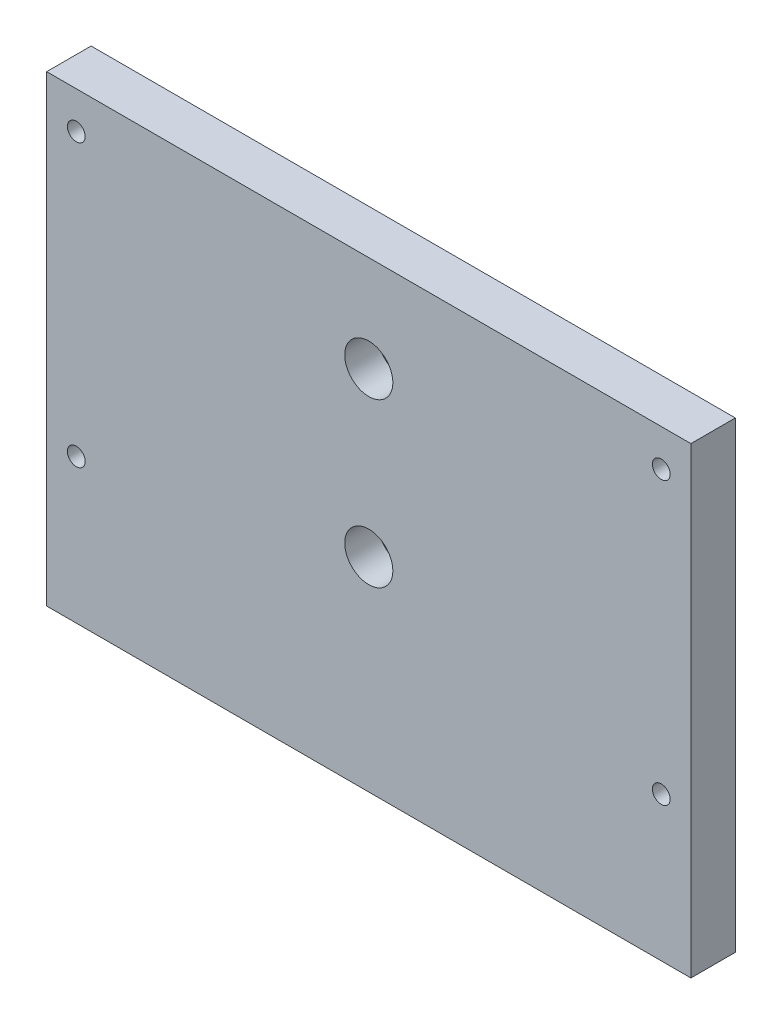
ISO-10303-21;
HEADER;
FILE_DESCRIPTION(('STEP AP214'),'2;1');
FILE_NAME('part.step','',(''),(''),'','','');
FILE_SCHEMA(('AUTOMOTIVE_DESIGN { 1 0 10303 214 1 1 1 1 }'));
ENDSEC;
DATA;
#1=APPLICATION_CONTEXT('core data for automotive mechanical design processes');
#2=APPLICATION_PROTOCOL_DEFINITION('international standard','automotive_design',2000,#1);
#3=PRODUCT_CONTEXT('',#1,'mechanical');
#4=PRODUCT('Part','Part','',(#3));
#5=PRODUCT_RELATED_PRODUCT_CATEGORY('part','',(#4));
#6=PRODUCT_DEFINITION_FORMATION('','',#4);
#7=PRODUCT_DEFINITION_CONTEXT('part definition',#1,'design');
#8=PRODUCT_DEFINITION('design','',#6,#7);
#9=PRODUCT_DEFINITION_SHAPE('','',#8);
#10=(LENGTH_UNIT() NAMED_UNIT(*) SI_UNIT(.MILLI.,.METRE.));
#11=(NAMED_UNIT(*) PLANE_ANGLE_UNIT() SI_UNIT($,.RADIAN.));
#12=(NAMED_UNIT(*) SI_UNIT($,.STERADIAN.) SOLID_ANGLE_UNIT());
#13=UNCERTAINTY_MEASURE_WITH_UNIT(LENGTH_MEASURE(1.E-05),#10,'distance_accuracy_value','');
#14=(GEOMETRIC_REPRESENTATION_CONTEXT(3) GLOBAL_UNCERTAINTY_ASSIGNED_CONTEXT((#13)) GLOBAL_UNIT_ASSIGNED_CONTEXT((#10,
#11,#12)) REPRESENTATION_CONTEXT('',''));
#15=CARTESIAN_POINT('',(0.,0.,0.));
#16=DIRECTION('',(0.,0.,1.));
#17=DIRECTION('',(1.,0.,0.));
#18=AXIS2_PLACEMENT_3D('',#15,#16,#17);
#19=CARTESIAN_POINT('',(-87.,62.5,12.));
#20=DIRECTION('',(1.,0.,0.));
#21=DIRECTION('',(0.,1.,0.));
#22=AXIS2_PLACEMENT_3D('',#19,#20,#21);
#23=PLANE('',#22);
#24=CARTESIAN_POINT('',(-87.,36.5,6.));
#25=DIRECTION('',(-1.,0.,0.));
#26=DIRECTION('',(0.,0.,1.));
#27=AXIS2_PLACEMENT_3D('',#24,#25,#26);
#28=CIRCLE('',#27,2.39999999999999);
#29=CARTESIAN_POINT('',(-87.,36.5,8.4));
#30=VERTEX_POINT('',#29);
#31=EDGE_CURVE('E83',#30,#30,#28,.T.);
#32=ORIENTED_EDGE('',*,*,#31,.F.);
#33=EDGE_LOOP('',(#32));
#34=FACE_BOUND('',#33,.T.);
#35=CARTESIAN_POINT('',(-87.,-7.5,6.00000000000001));
#36=DIRECTION('',(-1.,0.,0.));
#37=DIRECTION('',(0.,0.,1.));
#38=AXIS2_PLACEMENT_3D('',#35,#36,#37);
#39=CIRCLE('',#38,2.39999999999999);
#40=CARTESIAN_POINT('',(-87.,-7.5,8.4));
#41=VERTEX_POINT('',#40);
#42=EDGE_CURVE('E91',#41,#41,#39,.T.);
#43=ORIENTED_EDGE('',*,*,#42,.F.);
#44=EDGE_LOOP('',(#43));
#45=FACE_BOUND('',#44,.T.);
#46=DIRECTION('',(0.,-1.,0.));
#47=VECTOR('',#46,1.);
#48=CARTESIAN_POINT('',(-87.,62.5,0.));
#49=LINE('',#48,#47);
#50=CARTESIAN_POINT('',(-87.,62.5,0.));
#51=VERTEX_POINT('',#50);
#52=CARTESIAN_POINT('',(-87.,-62.5,0.));
#53=VERTEX_POINT('',#52);
#54=EDGE_CURVE('E142',#51,#53,#49,.T.);
#55=ORIENTED_EDGE('',*,*,#54,.T.);
#56=DIRECTION('',(0.,0.,-1.));
#57=VECTOR('',#56,1.);
#58=CARTESIAN_POINT('',(-87.,-62.5,12.));
#59=LINE('',#58,#57);
#60=CARTESIAN_POINT('',(-87.,-62.5,12.));
#61=VERTEX_POINT('',#60);
#62=EDGE_CURVE('E11',#61,#53,#59,.T.);
#63=ORIENTED_EDGE('',*,*,#62,.F.);
#64=DIRECTION('',(0.,-1.,0.));
#65=VECTOR('',#64,1.);
#66=CARTESIAN_POINT('',(-87.,62.5,12.));
#67=LINE('',#66,#65);
#68=CARTESIAN_POINT('',(-87.,62.5,12.));
#69=VERTEX_POINT('',#68);
#70=EDGE_CURVE('E151',#69,#61,#67,.T.);
#71=ORIENTED_EDGE('',*,*,#70,.F.);
#72=DIRECTION('',(0.,0.,-1.));
#73=VECTOR('',#72,1.);
#74=CARTESIAN_POINT('',(-87.,62.5,12.));
#75=LINE('',#74,#73);
#76=EDGE_CURVE('E157',#69,#51,#75,.T.);
#77=ORIENTED_EDGE('',*,*,#76,.T.);
#78=EDGE_LOOP('',(#55,#63,#71,#77));
#79=FACE_BOUND('',#78,.T.);
#80=ADVANCED_FACE('F30',(#34,#45,#79),#23,.F.);
#81=CARTESIAN_POINT('',(-87.,-62.5,12.));
#82=DIRECTION('',(0.,1.,0.));
#83=DIRECTION('',(0.,0.,1.));
#84=AXIS2_PLACEMENT_3D('',#81,#82,#83);
#85=PLANE('',#84);
#86=DIRECTION('',(1.,0.,0.));
#87=VECTOR('',#86,1.);
#88=CARTESIAN_POINT('',(-87.,-62.5,0.));
#89=LINE('',#88,#87);
#90=CARTESIAN_POINT('',(87.,-62.5,0.));
#91=VERTEX_POINT('',#90);
#92=EDGE_CURVE('E145',#53,#91,#89,.T.);
#93=ORIENTED_EDGE('',*,*,#92,.T.);
#94=DIRECTION('',(0.,0.,-1.));
#95=VECTOR('',#94,1.);
#96=CARTESIAN_POINT('',(87.,-62.5,12.));
#97=LINE('',#96,#95);
#98=CARTESIAN_POINT('',(87.,-62.5,12.));
#99=VERTEX_POINT('',#98);
#100=EDGE_CURVE('E37',#99,#91,#97,.T.);
#101=ORIENTED_EDGE('',*,*,#100,.F.);
#102=DIRECTION('',(1.,0.,0.));
#103=VECTOR('',#102,1.);
#104=CARTESIAN_POINT('',(-87.,-62.5,12.));
#105=LINE('',#104,#103);
#106=EDGE_CURVE('E153',#61,#99,#105,.T.);
#107=ORIENTED_EDGE('',*,*,#106,.F.);
#108=ORIENTED_EDGE('',*,*,#62,.T.);
#109=EDGE_LOOP('',(#93,#101,#107,#108));
#110=FACE_BOUND('',#109,.T.);
#111=ADVANCED_FACE('F178',(#110),#85,.F.);
#112=CARTESIAN_POINT('',(87.,62.5,12.));
#113=DIRECTION('',(-1.,0.,0.));
#114=DIRECTION('',(0.,-1.,0.));
#115=AXIS2_PLACEMENT_3D('',#112,#113,#114);
#116=PLANE('',#115);
#117=DIRECTION('',(0.,1.,0.));
#118=VECTOR('',#117,1.);
#119=CARTESIAN_POINT('',(87.,62.5,0.));
#120=LINE('',#119,#118);
#121=CARTESIAN_POINT('',(87.,62.5,0.));
#122=VERTEX_POINT('',#121);
#123=EDGE_CURVE('E147',#91,#122,#120,.T.);
#124=ORIENTED_EDGE('',*,*,#123,.T.);
#125=DIRECTION('',(0.,0.,-1.));
#126=VECTOR('',#125,1.);
#127=CARTESIAN_POINT('',(87.,62.5,12.));
#128=LINE('',#127,#126);
#129=CARTESIAN_POINT('',(87.,62.5,12.));
#130=VERTEX_POINT('',#129);
#131=EDGE_CURVE('E160',#130,#122,#128,.T.);
#132=ORIENTED_EDGE('',*,*,#131,.F.);
#133=DIRECTION('',(0.,1.,0.));
#134=VECTOR('',#133,1.);
#135=CARTESIAN_POINT('',(87.,62.5,12.));
#136=LINE('',#135,#134);
#137=EDGE_CURVE('E49',#99,#130,#136,.T.);
#138=ORIENTED_EDGE('',*,*,#137,.F.);
#139=ORIENTED_EDGE('',*,*,#100,.T.);
#140=EDGE_LOOP('',(#124,#132,#138,#139));
#141=FACE_BOUND('',#140,.T.);
#142=ADVANCED_FACE('F166',(#141),#116,.F.);
#143=CARTESIAN_POINT('',(-87.,62.5,12.));
#144=DIRECTION('',(0.,-1.,0.));
#145=DIRECTION('',(0.,0.,-1.));
#146=AXIS2_PLACEMENT_3D('',#143,#144,#145);
#147=PLANE('',#146);
#148=DIRECTION('',(-1.,0.,0.));
#149=VECTOR('',#148,1.);
#150=CARTESIAN_POINT('',(-87.,62.5,0.));
#151=LINE('',#150,#149);
#152=EDGE_CURVE('E149',#122,#51,#151,.T.);
#153=ORIENTED_EDGE('',*,*,#152,.T.);
#154=ORIENTED_EDGE('',*,*,#76,.F.);
#155=DIRECTION('',(-1.,0.,0.));
#156=VECTOR('',#155,1.);
#157=CARTESIAN_POINT('',(-87.,62.5,12.));
#158=LINE('',#157,#156);
#159=EDGE_CURVE('E44',#130,#69,#158,.T.);
#160=ORIENTED_EDGE('',*,*,#159,.F.);
#161=ORIENTED_EDGE('',*,*,#131,.T.);
#162=EDGE_LOOP('',(#153,#154,#160,#161));
#163=FACE_BOUND('',#162,.T.);
#164=ADVANCED_FACE('F173',(#163),#147,.F.);
#165=CARTESIAN_POINT('',(-87.,-62.5,12.));
#166=DIRECTION('',(0.,0.,1.));
#167=DIRECTION('',(1.,0.,0.));
#168=AXIS2_PLACEMENT_3D('',#165,#166,#167);
#169=PLANE('',#168);
#170=CARTESIAN_POINT('',(-79.,-23.5,12.));
#171=DIRECTION('',(0.,0.,1.));
#172=DIRECTION('',(1.,0.,0.));
#173=AXIS2_PLACEMENT_3D('',#170,#171,#172);
#174=CIRCLE('',#173,2.4);
#175=CARTESIAN_POINT('',(-76.6,-23.5,12.));
#176=VERTEX_POINT('',#175);
#177=EDGE_CURVE('E97',#176,#176,#174,.T.);
#178=ORIENTED_EDGE('',*,*,#177,.F.);
#179=EDGE_LOOP('',(#178));
#180=FACE_BOUND('',#179,.T.);
#181=CARTESIAN_POINT('',(-79.,52.5,12.));
#182=DIRECTION('',(0.,0.,1.));
#183=DIRECTION('',(1.,0.,0.));
#184=AXIS2_PLACEMENT_3D('',#181,#182,#183);
#185=CIRCLE('',#184,2.4);
#186=CARTESIAN_POINT('',(-76.6,52.5,12.));
#187=VERTEX_POINT('',#186);
#188=EDGE_CURVE('E103',#187,#187,#185,.T.);
#189=ORIENTED_EDGE('',*,*,#188,.F.);
#190=EDGE_LOOP('',(#189));
#191=FACE_BOUND('',#190,.T.);
#192=CARTESIAN_POINT('',(79.,-23.5,12.));
#193=DIRECTION('',(0.,0.,1.));
#194=DIRECTION('',(1.,0.,0.));
#195=AXIS2_PLACEMENT_3D('',#192,#193,#194);
#196=CIRCLE('',#195,2.4);
#197=CARTESIAN_POINT('',(81.4,-23.5,12.));
#198=VERTEX_POINT('',#197);
#199=EDGE_CURVE('E109',#198,#198,#196,.T.);
#200=ORIENTED_EDGE('',*,*,#199,.F.);
#201=EDGE_LOOP('',(#200));
#202=FACE_BOUND('',#201,.T.);
#203=CARTESIAN_POINT('',(79.,52.5,12.));
#204=DIRECTION('',(0.,0.,1.));
#205=DIRECTION('',(1.,0.,0.));
#206=AXIS2_PLACEMENT_3D('',#203,#204,#205);
#207=CIRCLE('',#206,2.4);
#208=CARTESIAN_POINT('',(81.4,52.5,12.));
#209=VERTEX_POINT('',#208);
#210=EDGE_CURVE('E115',#209,#209,#207,.T.);
#211=ORIENTED_EDGE('',*,*,#210,.F.);
#212=EDGE_LOOP('',(#211));
#213=FACE_BOUND('',#212,.T.);
#214=CARTESIAN_POINT('',(0.,-7.50000000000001,12.));
#215=DIRECTION('',(0.,0.,1.));
#216=DIRECTION('',(1.,0.,0.));
#217=AXIS2_PLACEMENT_3D('',#214,#215,#216);
#218=CIRCLE('',#217,6.5);
#219=CARTESIAN_POINT('',(6.50000000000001,-7.50000000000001,12.));
#220=VERTEX_POINT('',#219);
#221=EDGE_CURVE('E127',#220,#220,#218,.T.);
#222=ORIENTED_EDGE('',*,*,#221,.F.);
#223=EDGE_LOOP('',(#222));
#224=FACE_BOUND('',#223,.T.);
#225=CARTESIAN_POINT('',(0.,36.5,12.));
#226=DIRECTION('',(0.,0.,1.));
#227=DIRECTION('',(1.,0.,0.));
#228=AXIS2_PLACEMENT_3D('',#225,#226,#227);
#229=CIRCLE('',#228,6.5);
#230=CARTESIAN_POINT('',(6.5,36.5,12.));
#231=VERTEX_POINT('',#230);
#232=EDGE_CURVE('E139',#231,#231,#229,.T.);
#233=ORIENTED_EDGE('',*,*,#232,.F.);
#234=EDGE_LOOP('',(#233));
#235=FACE_BOUND('',#234,.T.);
#236=ORIENTED_EDGE('',*,*,#70,.T.);
#237=ORIENTED_EDGE('',*,*,#106,.T.);
#238=ORIENTED_EDGE('',*,*,#137,.T.);
#239=ORIENTED_EDGE('',*,*,#159,.T.);
#240=EDGE_LOOP('',(#236,#237,#238,#239));
#241=FACE_BOUND('',#240,.T.);
#242=ADVANCED_FACE('F177',(#180,#191,#202,#213,#224,#235,#241),#169,.T.);
#243=CARTESIAN_POINT('',(-87.,-62.5,0.));
#244=DIRECTION('',(0.,0.,1.));
#245=DIRECTION('',(1.,0.,0.));
#246=AXIS2_PLACEMENT_3D('',#243,#244,#245);
#247=PLANE('',#246);
#248=CARTESIAN_POINT('',(-79.,-23.5,0.));
#249=DIRECTION('',(0.,0.,1.));
#250=DIRECTION('',(1.,0.,0.));
#251=AXIS2_PLACEMENT_3D('',#248,#249,#250);
#252=CIRCLE('',#251,2.4);
#253=CARTESIAN_POINT('',(-76.6,-23.5,0.));
#254=VERTEX_POINT('',#253);
#255=EDGE_CURVE('E94',#254,#254,#252,.T.);
#256=ORIENTED_EDGE('',*,*,#255,.T.);
#257=EDGE_LOOP('',(#256));
#258=FACE_BOUND('',#257,.T.);
#259=CARTESIAN_POINT('',(-79.,52.5,0.));
#260=DIRECTION('',(0.,0.,1.));
#261=DIRECTION('',(1.,0.,0.));
#262=AXIS2_PLACEMENT_3D('',#259,#260,#261);
#263=CIRCLE('',#262,2.4);
#264=CARTESIAN_POINT('',(-76.6,52.5,0.));
#265=VERTEX_POINT('',#264);
#266=EDGE_CURVE('E100',#265,#265,#263,.T.);
#267=ORIENTED_EDGE('',*,*,#266,.T.);
#268=EDGE_LOOP('',(#267));
#269=FACE_BOUND('',#268,.T.);
#270=CARTESIAN_POINT('',(79.,-23.5,0.));
#271=DIRECTION('',(0.,0.,1.));
#272=DIRECTION('',(1.,0.,0.));
#273=AXIS2_PLACEMENT_3D('',#270,#271,#272);
#274=CIRCLE('',#273,2.4);
#275=CARTESIAN_POINT('',(81.4,-23.5,0.));
#276=VERTEX_POINT('',#275);
#277=EDGE_CURVE('E106',#276,#276,#274,.T.);
#278=ORIENTED_EDGE('',*,*,#277,.T.);
#279=EDGE_LOOP('',(#278));
#280=FACE_BOUND('',#279,.T.);
#281=CARTESIAN_POINT('',(79.,52.5,0.));
#282=DIRECTION('',(0.,0.,1.));
#283=DIRECTION('',(1.,0.,0.));
#284=AXIS2_PLACEMENT_3D('',#281,#282,#283);
#285=CIRCLE('',#284,2.4);
#286=CARTESIAN_POINT('',(81.4,52.5,0.));
#287=VERTEX_POINT('',#286);
#288=EDGE_CURVE('E112',#287,#287,#285,.T.);
#289=ORIENTED_EDGE('',*,*,#288,.T.);
#290=EDGE_LOOP('',(#289));
#291=FACE_BOUND('',#290,.T.);
#292=CARTESIAN_POINT('',(0.,-7.50000000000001,0.));
#293=DIRECTION('',(0.,0.,1.));
#294=DIRECTION('',(1.,0.,0.));
#295=AXIS2_PLACEMENT_3D('',#292,#293,#294);
#296=CIRCLE('',#295,3.3);
#297=CARTESIAN_POINT('',(3.30000000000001,-7.50000000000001,0.));
#298=VERTEX_POINT('',#297);
#299=EDGE_CURVE('E118',#298,#298,#296,.T.);
#300=ORIENTED_EDGE('',*,*,#299,.T.);
#301=EDGE_LOOP('',(#300));
#302=FACE_BOUND('',#301,.T.);
#303=CARTESIAN_POINT('',(0.,36.5,0.));
#304=DIRECTION('',(0.,0.,1.));
#305=DIRECTION('',(1.,0.,0.));
#306=AXIS2_PLACEMENT_3D('',#303,#304,#305);
#307=CIRCLE('',#306,3.3);
#308=CARTESIAN_POINT('',(3.3,36.5,0.));
#309=VERTEX_POINT('',#308);
#310=EDGE_CURVE('E130',#309,#309,#307,.T.);
#311=ORIENTED_EDGE('',*,*,#310,.T.);
#312=EDGE_LOOP('',(#311));
#313=FACE_BOUND('',#312,.T.);
#314=ORIENTED_EDGE('',*,*,#54,.F.);
#315=ORIENTED_EDGE('',*,*,#152,.F.);
#316=ORIENTED_EDGE('',*,*,#123,.F.);
#317=ORIENTED_EDGE('',*,*,#92,.F.);
#318=EDGE_LOOP('',(#314,#315,#316,#317));
#319=FACE_BOUND('',#318,.T.);
#320=ADVANCED_FACE('F171',(#258,#269,#280,#291,#302,#313,#319),#247,.F.);
#321=CARTESIAN_POINT('',(0.,36.5,12.));
#322=DIRECTION('',(0.,0.,1.));
#323=DIRECTION('',(1.,0.,0.));
#324=AXIS2_PLACEMENT_3D('',#321,#322,#323);
#325=CYLINDRICAL_SURFACE('',#324,6.5);
#326=CARTESIAN_POINT('',(0.,36.5,3.));
#327=DIRECTION('',(0.,0.,1.));
#328=DIRECTION('',(1.,0.,0.));
#329=AXIS2_PLACEMENT_3D('',#326,#327,#328);
#330=CIRCLE('',#329,6.5);
#331=CARTESIAN_POINT('',(6.5,36.5,3.));
#332=VERTEX_POINT('',#331);
#333=EDGE_CURVE('E136',#332,#332,#330,.T.);
#334=ORIENTED_EDGE('',*,*,#333,.F.);
#335=EDGE_LOOP('',(#334));
#336=FACE_BOUND('',#335,.T.);
#337=ORIENTED_EDGE('',*,*,#232,.T.);
#338=EDGE_LOOP('',(#337));
#339=FACE_BOUND('',#338,.T.);
#340=ADVANCED_FACE('F194',(#336,#339),#325,.F.);
#341=CARTESIAN_POINT('',(3.3,36.5,3.));
#342=DIRECTION('',(0.,0.,-1.));
#343=DIRECTION('',(-1.,0.,0.));
#344=AXIS2_PLACEMENT_3D('',#341,#342,#343);
#345=PLANE('',#344);
#346=CARTESIAN_POINT('',(0.,36.5,3.));
#347=DIRECTION('',(0.,0.,1.));
#348=DIRECTION('',(1.,0.,0.));
#349=AXIS2_PLACEMENT_3D('',#346,#347,#348);
#350=CIRCLE('',#349,3.3);
#351=CARTESIAN_POINT('',(3.3,36.5,3.));
#352=VERTEX_POINT('',#351);
#353=EDGE_CURVE('E133',#352,#352,#350,.T.);
#354=ORIENTED_EDGE('',*,*,#353,.F.);
#355=EDGE_LOOP('',(#354));
#356=FACE_BOUND('',#355,.T.);
#357=ORIENTED_EDGE('',*,*,#333,.T.);
#358=EDGE_LOOP('',(#357));
#359=FACE_BOUND('',#358,.T.);
#360=ADVANCED_FACE('F198',(#356,#359),#345,.F.);
#361=CARTESIAN_POINT('',(0.,36.5,12.));
#362=DIRECTION('',(0.,0.,1.));
#363=DIRECTION('',(1.,0.,0.));
#364=AXIS2_PLACEMENT_3D('',#361,#362,#363);
#365=CYLINDRICAL_SURFACE('',#364,3.3);
#366=ORIENTED_EDGE('',*,*,#310,.F.);
#367=EDGE_LOOP('',(#366));
#368=FACE_BOUND('',#367,.T.);
#369=ORIENTED_EDGE('',*,*,#353,.T.);
#370=EDGE_LOOP('',(#369));
#371=FACE_BOUND('',#370,.T.);
#372=ADVANCED_FACE('F202',(#368,#371),#365,.F.);
#373=CARTESIAN_POINT('',(0.,-7.50000000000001,12.));
#374=DIRECTION('',(0.,0.,1.));
#375=DIRECTION('',(1.,0.,0.));
#376=AXIS2_PLACEMENT_3D('',#373,#374,#375);
#377=CYLINDRICAL_SURFACE('',#376,6.5);
#378=CARTESIAN_POINT('',(0.,-7.50000000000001,3.));
#379=DIRECTION('',(0.,0.,1.));
#380=DIRECTION('',(1.,0.,0.));
#381=AXIS2_PLACEMENT_3D('',#378,#379,#380);
#382=CIRCLE('',#381,6.5);
#383=CARTESIAN_POINT('',(6.50000000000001,-7.50000000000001,3.));
#384=VERTEX_POINT('',#383);
#385=EDGE_CURVE('E124',#384,#384,#382,.T.);
#386=ORIENTED_EDGE('',*,*,#385,.F.);
#387=EDGE_LOOP('',(#386));
#388=FACE_BOUND('',#387,.T.);
#389=ORIENTED_EDGE('',*,*,#221,.T.);
#390=EDGE_LOOP('',(#389));
#391=FACE_BOUND('',#390,.T.);
#392=ADVANCED_FACE('F206',(#388,#391),#377,.F.);
#393=CARTESIAN_POINT('',(3.30000000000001,-7.50000000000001,3.));
#394=DIRECTION('',(0.,0.,-1.));
#395=DIRECTION('',(-1.,0.,0.));
#396=AXIS2_PLACEMENT_3D('',#393,#394,#395);
#397=PLANE('',#396);
#398=CARTESIAN_POINT('',(0.,-7.50000000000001,3.));
#399=DIRECTION('',(0.,0.,1.));
#400=DIRECTION('',(1.,0.,0.));
#401=AXIS2_PLACEMENT_3D('',#398,#399,#400);
#402=CIRCLE('',#401,3.3);
#403=CARTESIAN_POINT('',(3.30000000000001,-7.50000000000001,3.));
#404=VERTEX_POINT('',#403);
#405=EDGE_CURVE('E121',#404,#404,#402,.T.);
#406=ORIENTED_EDGE('',*,*,#405,.F.);
#407=EDGE_LOOP('',(#406));
#408=FACE_BOUND('',#407,.T.);
#409=ORIENTED_EDGE('',*,*,#385,.T.);
#410=EDGE_LOOP('',(#409));
#411=FACE_BOUND('',#410,.T.);
#412=ADVANCED_FACE('F210',(#408,#411),#397,.F.);
#413=CARTESIAN_POINT('',(0.,-7.50000000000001,12.));
#414=DIRECTION('',(0.,0.,1.));
#415=DIRECTION('',(1.,0.,0.));
#416=AXIS2_PLACEMENT_3D('',#413,#414,#415);
#417=CYLINDRICAL_SURFACE('',#416,3.3);
#418=ORIENTED_EDGE('',*,*,#299,.F.);
#419=EDGE_LOOP('',(#418));
#420=FACE_BOUND('',#419,.T.);
#421=ORIENTED_EDGE('',*,*,#405,.T.);
#422=EDGE_LOOP('',(#421));
#423=FACE_BOUND('',#422,.T.);
#424=ADVANCED_FACE('F214',(#420,#423),#417,.F.);
#425=CARTESIAN_POINT('',(79.,52.5,12.));
#426=DIRECTION('',(0.,0.,1.));
#427=DIRECTION('',(1.,0.,0.));
#428=AXIS2_PLACEMENT_3D('',#425,#426,#427);
#429=CYLINDRICAL_SURFACE('',#428,2.4);
#430=ORIENTED_EDGE('',*,*,#288,.F.);
#431=EDGE_LOOP('',(#430));
#432=FACE_BOUND('',#431,.T.);
#433=ORIENTED_EDGE('',*,*,#210,.T.);
#434=EDGE_LOOP('',(#433));
#435=FACE_BOUND('',#434,.T.);
#436=ADVANCED_FACE('F218',(#432,#435),#429,.F.);
#437=CARTESIAN_POINT('',(79.,-23.5,12.));
#438=DIRECTION('',(0.,0.,1.));
#439=DIRECTION('',(1.,0.,0.));
#440=AXIS2_PLACEMENT_3D('',#437,#438,#439);
#441=CYLINDRICAL_SURFACE('',#440,2.4);
#442=ORIENTED_EDGE('',*,*,#277,.F.);
#443=EDGE_LOOP('',(#442));
#444=FACE_BOUND('',#443,.T.);
#445=ORIENTED_EDGE('',*,*,#199,.T.);
#446=EDGE_LOOP('',(#445));
#447=FACE_BOUND('',#446,.T.);
#448=ADVANCED_FACE('F222',(#444,#447),#441,.F.);
#449=CARTESIAN_POINT('',(-79.,52.5,12.));
#450=DIRECTION('',(0.,0.,1.));
#451=DIRECTION('',(1.,0.,0.));
#452=AXIS2_PLACEMENT_3D('',#449,#450,#451);
#453=CYLINDRICAL_SURFACE('',#452,2.4);
#454=ORIENTED_EDGE('',*,*,#266,.F.);
#455=EDGE_LOOP('',(#454));
#456=FACE_BOUND('',#455,.T.);
#457=ORIENTED_EDGE('',*,*,#188,.T.);
#458=EDGE_LOOP('',(#457));
#459=FACE_BOUND('',#458,.T.);
#460=ADVANCED_FACE('F226',(#456,#459),#453,.F.);
#461=CARTESIAN_POINT('',(-79.,-23.5,12.));
#462=DIRECTION('',(0.,0.,1.));
#463=DIRECTION('',(1.,0.,0.));
#464=AXIS2_PLACEMENT_3D('',#461,#462,#463);
#465=CYLINDRICAL_SURFACE('',#464,2.4);
#466=ORIENTED_EDGE('',*,*,#255,.F.);
#467=EDGE_LOOP('',(#466));
#468=FACE_BOUND('',#467,.T.);
#469=ORIENTED_EDGE('',*,*,#177,.T.);
#470=EDGE_LOOP('',(#469));
#471=FACE_BOUND('',#470,.T.);
#472=ADVANCED_FACE('F230',(#468,#471),#465,.F.);
#473=CARTESIAN_POINT('',(-87.,-7.5,6.00000000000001));
#474=DIRECTION('',(-1.,0.,0.));
#475=DIRECTION('',(0.,0.,1.));
#476=AXIS2_PLACEMENT_3D('',#473,#474,#475);
#477=CYLINDRICAL_SURFACE('',#476,2.39999999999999);
#478=CARTESIAN_POINT('',(-57.,-7.5,6.00000000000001));
#479=DIRECTION('',(-1.,0.,0.));
#480=DIRECTION('',(0.,0.,1.));
#481=AXIS2_PLACEMENT_3D('',#478,#479,#480);
#482=CIRCLE('',#481,2.39999999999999);
#483=CARTESIAN_POINT('',(-57.,-7.5,8.4));
#484=VERTEX_POINT('',#483);
#485=EDGE_CURVE('E86',#484,#484,#482,.T.);
#486=ORIENTED_EDGE('',*,*,#485,.F.);
#487=EDGE_LOOP('',(#486));
#488=FACE_BOUND('',#487,.T.);
#489=ORIENTED_EDGE('',*,*,#42,.T.);
#490=EDGE_LOOP('',(#489));
#491=FACE_BOUND('',#490,.T.);
#492=ADVANCED_FACE('F234',(#488,#491),#477,.F.);
#493=CARTESIAN_POINT('',(-57.,-7.5,6.00000000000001));
#494=DIRECTION('',(-1.,0.,0.));
#495=DIRECTION('',(0.,0.,1.));
#496=AXIS2_PLACEMENT_3D('',#493,#494,#495);
#497=CONICAL_SURFACE('',#496,2.39999999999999,1.02974425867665);
#498=CARTESIAN_POINT('',(-55.5579345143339,-7.50000000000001,6.00000000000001));
#499=VERTEX_POINT('',#498);
#500=VERTEX_LOOP('',#499);
#501=FACE_BOUND('',#500,.T.);
#502=ORIENTED_EDGE('',*,*,#485,.T.);
#503=EDGE_LOOP('',(#502));
#504=FACE_BOUND('',#503,.T.);
#505=ADVANCED_FACE('F238',(#501,#504),#497,.F.);
#506=CARTESIAN_POINT('',(-87.,36.5,6.));
#507=DIRECTION('',(-1.,0.,0.));
#508=DIRECTION('',(0.,0.,1.));
#509=AXIS2_PLACEMENT_3D('',#506,#507,#508);
#510=CYLINDRICAL_SURFACE('',#509,2.39999999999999);
#511=CARTESIAN_POINT('',(-57.,36.5,6.));
#512=DIRECTION('',(-1.,0.,0.));
#513=DIRECTION('',(0.,0.,1.));
#514=AXIS2_PLACEMENT_3D('',#511,#512,#513);
#515=CIRCLE('',#514,2.39999999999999);
#516=CARTESIAN_POINT('',(-57.,36.5,8.4));
#517=VERTEX_POINT('',#516);
#518=EDGE_CURVE('E81',#517,#517,#515,.T.);
#519=ORIENTED_EDGE('',*,*,#518,.F.);
#520=EDGE_LOOP('',(#519));
#521=FACE_BOUND('',#520,.T.);
#522=ORIENTED_EDGE('',*,*,#31,.T.);
#523=EDGE_LOOP('',(#522));
#524=FACE_BOUND('',#523,.T.);
#525=ADVANCED_FACE('F77',(#521,#524),#510,.F.);
#526=CARTESIAN_POINT('',(-57.,36.5,6.));
#527=DIRECTION('',(-1.,0.,0.));
#528=DIRECTION('',(0.,0.,1.));
#529=AXIS2_PLACEMENT_3D('',#526,#527,#528);
#530=CONICAL_SURFACE('',#529,2.39999999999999,1.02974425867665);
#531=CARTESIAN_POINT('',(-55.5579345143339,36.5,6.));
#532=VERTEX_POINT('',#531);
#533=VERTEX_LOOP('',#532);
#534=FACE_BOUND('',#533,.T.);
#535=ORIENTED_EDGE('',*,*,#518,.T.);
#536=EDGE_LOOP('',(#535));
#537=FACE_BOUND('',#536,.T.);
#538=ADVANCED_FACE('F74',(#534,#537),#530,.F.);
#539=CLOSED_SHELL('',(#80,#111,#142,#164,#242,#320,#340,#360,#372,#392,#412,#424,#436,#448,#460,
#472,#492,#505,#525,#538));
#540=MANIFOLD_SOLID_BREP('B2',#539);
#541=ADVANCED_BREP_SHAPE_REPRESENTATION('',(#18,#540),#14);
#542=SHAPE_DEFINITION_REPRESENTATION(#9,#541);
ENDSEC;
END-ISO-10303-21;
